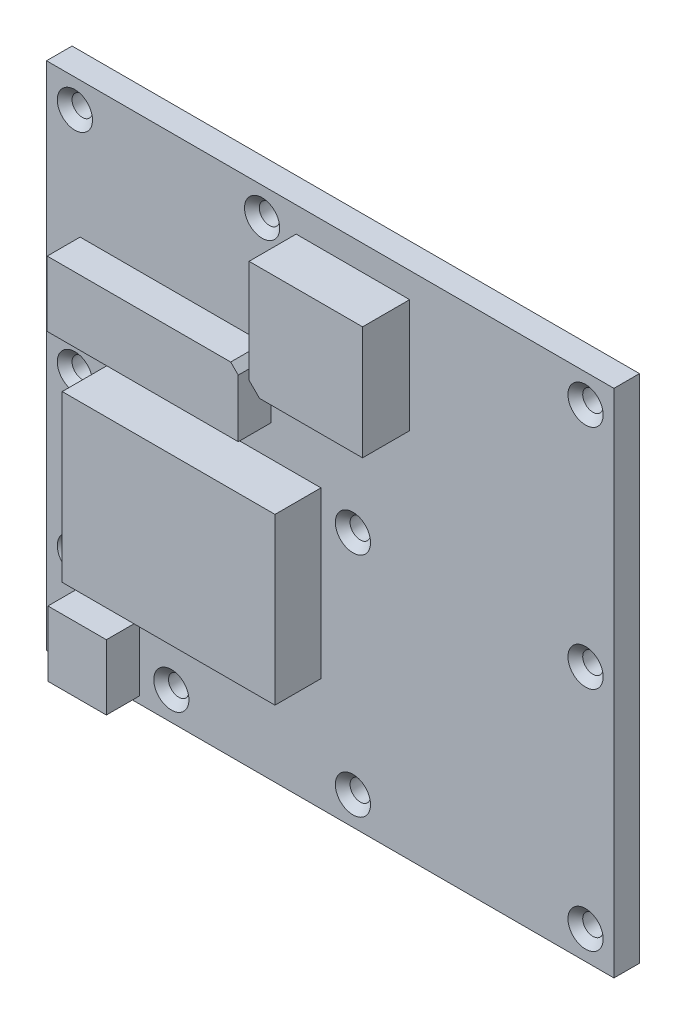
from build123d import *

# Parameters (mm, degrees)
SKETCH_1_W          = 100
SKETCH_1_H          = 90
EXTRUDE_1_DEPTH     = 4.5
SKETCH_2_W          = 37.499983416
SKETCH_2_H          = 29.1209
EXTRUDE_2_DEPTH     = 8.1
SKETCH_3_W          = 19.99998861
SKETCH_3_H          = 20.00001139
EXTRUDE_3_DEPTH     = 8.3
SKETCH_4_W          = 10.3002
SKETCH_4_H          = 11.500201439
EXTRUDE_4_DEPTH     = 5.8
SKETCH_5_R          = 1.8
CUT_EXTRUDE_1_DEPTH = 137.022119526
CUT_EXTRUDE_2_DEPTH = 8.3
CHAMFER_1_SIZE      = 1.3


with BuildPart() as part:
    # Sketch 1 → Extrude 1 (new body)
    with BuildSketch(Plane.XY):
        with Locations((77.0005, 3)):
            Rectangle(SKETCH_1_W, SKETCH_1_H)
    extrude(amount=EXTRUDE_1_DEPTH)

    # Sketch 2 → Extrude 2 (add)
    with BuildSketch(Plane.XY.offset(4.5)):
        with Locations((56.613068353, -7.569751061)):
            Rectangle(SKETCH_2_W, SKETCH_2_H)
    extrude(amount=EXTRUDE_2_DEPTH)

    # Sketch 3 → Extrude 3 (add)
    with BuildSketch(Plane.XY.offset(4.5)):
        with Locations((80.997091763, 33.535674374)):
            Rectangle(SKETCH_3_W, SKETCH_3_H)
    extrude(amount=EXTRUDE_3_DEPTH)

    # Sketch 4 → Extrude 4 (add)
    with BuildSketch(Plane.XY.offset(4.5)):
        Polygon((32.9209, 24.045801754), (66.5891, 24.045801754), (66.5891, 12.545582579), (32.9209, 12.545601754), align=None)
        with Locations((38.198, -35.04429928)):
            Rectangle(SKETCH_4_W, SKETCH_4_H)
    extrude(amount=EXTRUDE_4_DEPTH)

    # Sketch 5 → Cut-Extrude 1 (cut, through all)
    with BuildSketch(Plane.XY.offset(4.5)):
        with Locations((122.0005, 43)):
            Circle(SKETCH_5_R)
        with Locations((64.997097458, 43)):
            Circle(SKETCH_5_R)
        with Locations((32.0005, 43)):
            Circle(SKETCH_5_R)
        with Locations((81.0005, 3)):
            Circle(SKETCH_5_R)
        with Locations((122.0005, 3)):
            Circle(SKETCH_5_R)
        with Locations((49.0005, -37)):
            Circle(SKETCH_5_R)
        with Locations((122.0005, -37)):
            Circle(SKETCH_5_R)
        with Locations((32.0005, 3)):
            Circle(SKETCH_5_R)
        with Locations((81.0005, -37)):
            Circle(SKETCH_5_R)
        with Locations((32.0005, -25.029698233)):
            Circle(SKETCH_5_R)
    extrude(amount=-CUT_EXTRUDE_1_DEPTH, mode=Mode.SUBTRACT)

    # Sketch 6 → Cut-Extrude 2 (cut)
    with BuildSketch(Plane.XY.offset(12.8)):
        Polygon((68.642577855, 27.731856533), (73.499719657, 22.874714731), (69.964185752, 19.339180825), (65.107043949, 24.196322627), align=None)
    extrude(amount=-CUT_EXTRUDE_2_DEPTH, mode=Mode.SUBTRACT)

    # Chamfer 1
    chamfer_1_edges = [part.edges().sort_by_distance(p)[0] for p in [
        (120.2005, 43, 4.5),
        (79.2005, 3, 4.5),
        (120.2005, 3, 4.5),
        (120.2005, -37, 4.5),
        (47.2005, -37, 4.5),
        (30.2005, 3, 4.5),
        (30.2005, -25.029698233, 4.5),
        (30.2005, 43, 4.5),
        (63.197097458, 43, 4.5),
        (79.2005, -37, 4.5),
    ]]
    chamfer(chamfer_1_edges, length=CHAMFER_1_SIZE)


solid = part.part
